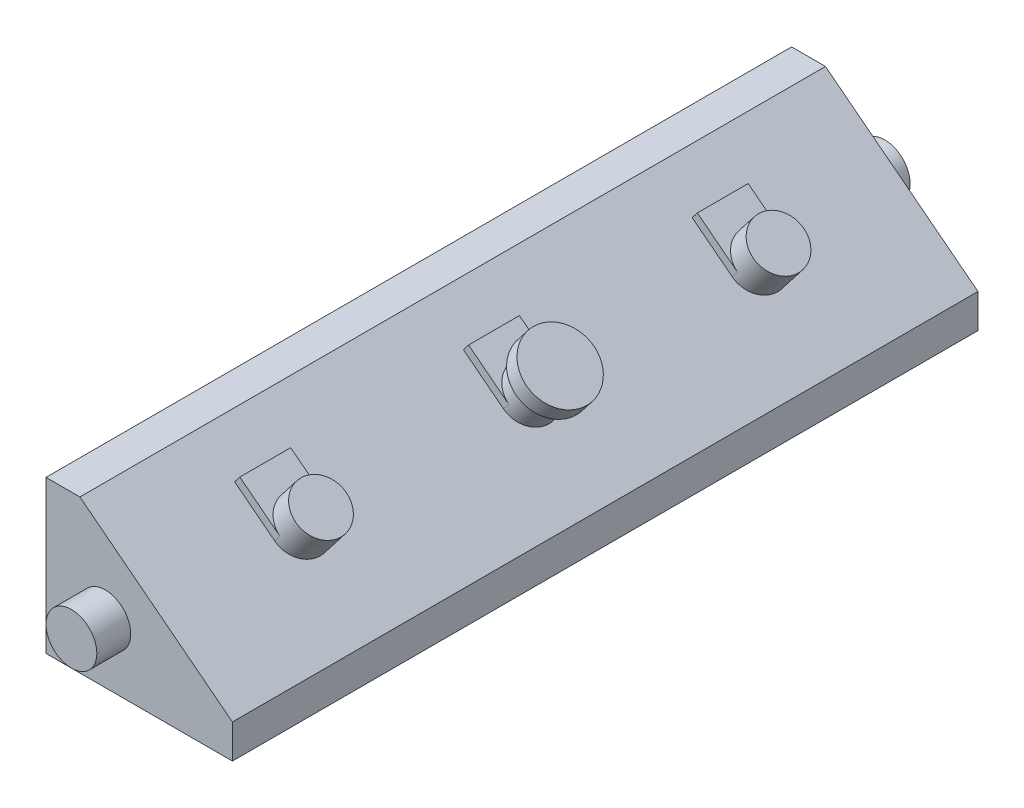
from build123d import *

# Parameters (mm, degrees)
EXTRUDE_1_DEPTH = 440
EXTRUDE_2_DEPTH = 5
SKETCH_3_R      = 15
EXTRUDE_3_DEPTH = 15
SKETCH_4_R      = 20
EXTRUDE_4_DEPTH = 10
SKETCH_5_R      = 15
EXTRUDE_5_DEPTH = 20
EXTRUDE_START   = 20
SKETCH_6_R      = 15
EXTRUDE_6_DEPTH = 20


with BuildPart() as part:
    # Sketch 1 → Extrude 1 (new body)
    with BuildSketch(Plane.XY):
        Polygon((0, 0), (0, -90), (110, -90), (110, -70), (20, 0), align=None)
    extrude(amount=EXTRUDE_1_DEPTH)

    # Sketch 2 → Extrude 2 (add)
    with BuildSketch(Plane(origin=(7.538461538, 9.692307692, 0), x_dir=(0.7893522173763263, -0.6139406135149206, 0), z_dir=(0.6139406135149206, 0.7893522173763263, 0))):
        with BuildLine():
            Line((72.795815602, -100), (42.795815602, -100))
            Line((42.795815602, -100), (42.795815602, -70))
            Line((42.795815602, -70), (72.795815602, -70))
            ThreePointArc((72.795815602, -70), (87.795815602, -85), (72.795815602, -100))
        make_face()
        with BuildLine():
            Line((72.795815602, -370), (42.795815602, -370))
            Line((42.795815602, -370), (42.795815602, -340))
            Line((42.795815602, -340), (72.795815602, -340))
            ThreePointArc((72.795815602, -340), (87.795815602, -355), (72.795815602, -370))
        make_face()
        with BuildLine():
            Line((72.795815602, -235), (42.795815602, -235))
            Line((42.795815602, -235), (42.795815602, -205))
            Line((42.795815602, -205), (72.795815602, -205))
            ThreePointArc((72.795815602, -205), (87.795815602, -220), (72.795815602, -235))
        make_face()
    extrude(amount=EXTRUDE_2_DEPTH)

    # Sketch 3 → Extrude 3 (add)
    with BuildSketch(Plane(origin=(10.608164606, 13.639068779, 0), x_dir=(0.7893522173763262, -0.6139406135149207, 0), z_dir=(0.6139406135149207, 0.7893522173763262, 0))):
        with Locations(Location((72.795815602, -355, 0), (0, 0, 90))):
            Circle(SKETCH_3_R)
        with Locations(Location((72.795815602, -220, 0), (0, 0, 90))):
            Circle(SKETCH_3_R)
        with Locations(Location((72.795815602, -85, 0), (0, 0, 90))):
            Circle(SKETCH_3_R)
    extrude(amount=EXTRUDE_3_DEPTH)

    # Sketch 4 → Extrude 4 (add)
    with BuildSketch(Plane(origin=(19.817273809, 25.47935204, 0), x_dir=(0.7893522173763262, -0.6139406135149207, 0), z_dir=(0.6139406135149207, 0.7893522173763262, 0))):
        with Locations(Location((72.795815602, -220, 0), (0, 0, 180))):
            Circle(SKETCH_4_R)
    extrude(amount=EXTRUDE_4_DEPTH)

    # Sketch 5 → Extrude 5 (add)
    with BuildSketch(Plane.XY.offset(440)):
        with Locations((35, -55)):
            Circle(SKETCH_5_R)
    extrude(amount=EXTRUDE_5_DEPTH)

    # Sketch 6 → Extrude 6 (add)
    with BuildSketch(Plane(origin=(0, 0, 0), x_dir=(-1, 0, 0), z_dir=(0, 0, -1)).offset(EXTRUDE_START)):
        with Locations(Location((-35, -55, 0), (0, 0, 180))):
            Circle(SKETCH_6_R)
    extrude(amount=-EXTRUDE_6_DEPTH)


solid = part.part
